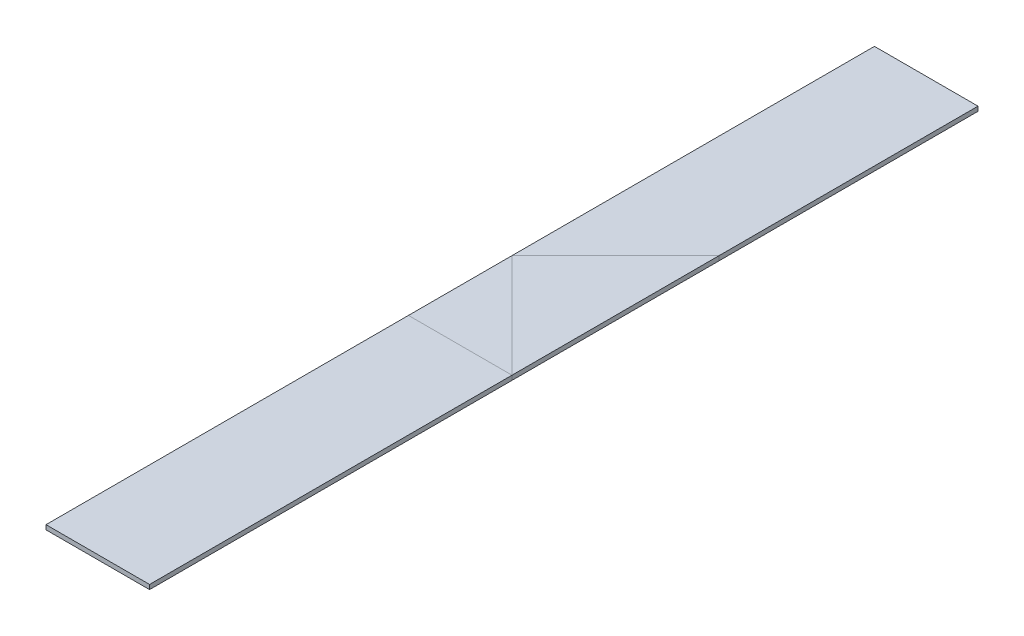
ISO-10303-21;
HEADER;
FILE_DESCRIPTION(('STEP AP214'),'2;1');
FILE_NAME('part.step','',(''),(''),'','','');
FILE_SCHEMA(('AUTOMOTIVE_DESIGN { 1 0 10303 214 1 1 1 1 }'));
ENDSEC;
DATA;
#1=APPLICATION_CONTEXT('core data for automotive mechanical design processes');
#2=APPLICATION_PROTOCOL_DEFINITION('international standard','automotive_design',2000,#1);
#3=PRODUCT_CONTEXT('',#1,'mechanical');
#4=PRODUCT('Part','Part','',(#3));
#5=PRODUCT_RELATED_PRODUCT_CATEGORY('part','',(#4));
#6=PRODUCT_DEFINITION_FORMATION('','',#4);
#7=PRODUCT_DEFINITION_CONTEXT('part definition',#1,'design');
#8=PRODUCT_DEFINITION('design','',#6,#7);
#9=PRODUCT_DEFINITION_SHAPE('','',#8);
#10=(LENGTH_UNIT() NAMED_UNIT(*) SI_UNIT(.MILLI.,.METRE.));
#11=(NAMED_UNIT(*) PLANE_ANGLE_UNIT() SI_UNIT($,.RADIAN.));
#12=(NAMED_UNIT(*) SI_UNIT($,.STERADIAN.) SOLID_ANGLE_UNIT());
#13=UNCERTAINTY_MEASURE_WITH_UNIT(LENGTH_MEASURE(1.E-05),#10,'distance_accuracy_value','');
#14=(GEOMETRIC_REPRESENTATION_CONTEXT(3) GLOBAL_UNCERTAINTY_ASSIGNED_CONTEXT((#13)) GLOBAL_UNIT_ASSIGNED_CONTEXT((#10,
#11,#12)) REPRESENTATION_CONTEXT('',''));
#15=CARTESIAN_POINT('',(0.,0.,0.));
#16=DIRECTION('',(0.,0.,1.));
#17=DIRECTION('',(1.,0.,0.));
#18=AXIS2_PLACEMENT_3D('',#15,#16,#17);
#19=CARTESIAN_POINT('',(0.,1.,-80.5));
#20=DIRECTION('',(0.,0.,-1.));
#21=DIRECTION('',(-1.,0.,0.));
#22=AXIS2_PLACEMENT_3D('',#19,#20,#21);
#23=PLANE('',#22);
#24=DIRECTION('',(1.,0.,0.));
#25=VECTOR('',#24,1.);
#26=CARTESIAN_POINT('',(0.,0.,-80.5));
#27=LINE('',#26,#25);
#28=CARTESIAN_POINT('',(0.,0.,-80.5));
#29=VERTEX_POINT('',#28);
#30=CARTESIAN_POINT('',(23.,0.,-80.5));
#31=VERTEX_POINT('',#30);
#32=EDGE_CURVE('E111',#29,#31,#27,.T.);
#33=ORIENTED_EDGE('',*,*,#32,.F.);
#34=DIRECTION('',(0.,-1.,0.));
#35=VECTOR('',#34,1.);
#36=CARTESIAN_POINT('',(0.,1.,-80.5));
#37=LINE('',#36,#35);
#38=CARTESIAN_POINT('',(0.,1.,-80.5));
#39=VERTEX_POINT('',#38);
#40=EDGE_CURVE('E12',#39,#29,#37,.T.);
#41=ORIENTED_EDGE('',*,*,#40,.F.);
#42=DIRECTION('',(1.,0.,0.));
#43=VECTOR('',#42,1.);
#44=CARTESIAN_POINT('',(0.,1.,-80.5));
#45=LINE('',#44,#43);
#46=CARTESIAN_POINT('',(23.,1.,-80.5));
#47=VERTEX_POINT('',#46);
#48=EDGE_CURVE('E105',#39,#47,#45,.T.);
#49=ORIENTED_EDGE('',*,*,#48,.T.);
#50=DIRECTION('',(0.,-1.,0.));
#51=VECTOR('',#50,1.);
#52=CARTESIAN_POINT('',(23.,1.,-80.5));
#53=LINE('',#52,#51);
#54=EDGE_CURVE('E86',#47,#31,#53,.T.);
#55=ORIENTED_EDGE('',*,*,#54,.T.);
#56=EDGE_LOOP('',(#33,#41,#49,#55));
#57=FACE_BOUND('',#56,.T.);
#58=ADVANCED_FACE('F48',(#57),#23,.T.);
#59=CARTESIAN_POINT('',(0.,1.,0.));
#60=DIRECTION('',(-1.,0.,0.));
#61=DIRECTION('',(0.,0.,1.));
#62=AXIS2_PLACEMENT_3D('',#59,#60,#61);
#63=PLANE('',#62);
#64=DIRECTION('',(0.,0.,-1.));
#65=VECTOR('',#64,1.);
#66=CARTESIAN_POINT('',(0.,0.,0.));
#67=LINE('',#66,#65);
#68=CARTESIAN_POINT('',(0.,0.,0.));
#69=VERTEX_POINT('',#68);
#70=EDGE_CURVE('E99',#69,#29,#67,.T.);
#71=ORIENTED_EDGE('',*,*,#70,.F.);
#72=DIRECTION('',(0.,-1.,0.));
#73=VECTOR('',#72,1.);
#74=CARTESIAN_POINT('',(0.,1.,0.));
#75=LINE('',#74,#73);
#76=CARTESIAN_POINT('',(0.,1.,0.));
#77=VERTEX_POINT('',#76);
#78=EDGE_CURVE('E56',#77,#69,#75,.T.);
#79=ORIENTED_EDGE('',*,*,#78,.F.);
#80=DIRECTION('',(0.,0.,-1.));
#81=VECTOR('',#80,1.);
#82=CARTESIAN_POINT('',(0.,1.,0.));
#83=LINE('',#82,#81);
#84=EDGE_CURVE('E97',#77,#39,#83,.T.);
#85=ORIENTED_EDGE('',*,*,#84,.T.);
#86=ORIENTED_EDGE('',*,*,#40,.T.);
#87=EDGE_LOOP('',(#71,#79,#85,#86));
#88=FACE_BOUND('',#87,.T.);
#89=ADVANCED_FACE('F95',(#88),#63,.T.);
#90=CARTESIAN_POINT('',(0.,1.,0.));
#91=DIRECTION('',(0.,0.,-1.));
#92=DIRECTION('',(-1.,0.,0.));
#93=AXIS2_PLACEMENT_3D('',#90,#91,#92);
#94=PLANE('',#93);
#95=DIRECTION('',(1.,0.,0.));
#96=VECTOR('',#95,1.);
#97=CARTESIAN_POINT('',(0.,0.,0.));
#98=LINE('',#97,#96);
#99=CARTESIAN_POINT('',(23.,0.,0.));
#100=VERTEX_POINT('',#99);
#101=EDGE_CURVE('E79',#69,#100,#98,.T.);
#102=ORIENTED_EDGE('',*,*,#101,.T.);
#103=DIRECTION('',(0.,-1.,0.));
#104=VECTOR('',#103,1.);
#105=CARTESIAN_POINT('',(23.,1.,0.));
#106=LINE('',#105,#104);
#107=CARTESIAN_POINT('',(23.,1.,0.));
#108=VERTEX_POINT('',#107);
#109=EDGE_CURVE('E100',#108,#100,#106,.T.);
#110=ORIENTED_EDGE('',*,*,#109,.F.);
#111=DIRECTION('',(1.,0.,0.));
#112=VECTOR('',#111,1.);
#113=CARTESIAN_POINT('',(0.,1.,0.));
#114=LINE('',#113,#112);
#115=EDGE_CURVE('E101',#77,#108,#114,.T.);
#116=ORIENTED_EDGE('',*,*,#115,.F.);
#117=ORIENTED_EDGE('',*,*,#78,.T.);
#118=EDGE_LOOP('',(#102,#110,#116,#117));
#119=FACE_BOUND('',#118,.T.);
#120=ADVANCED_FACE('F102',(#119),#94,.F.);
#121=CARTESIAN_POINT('',(23.,1.,0.));
#122=DIRECTION('',(-1.,0.,0.));
#123=DIRECTION('',(0.,0.,1.));
#124=AXIS2_PLACEMENT_3D('',#121,#122,#123);
#125=PLANE('',#124);
#126=DIRECTION('',(0.,0.,-1.));
#127=VECTOR('',#126,1.);
#128=CARTESIAN_POINT('',(23.,0.,0.));
#129=LINE('',#128,#127);
#130=EDGE_CURVE('E107',#100,#31,#129,.T.);
#131=ORIENTED_EDGE('',*,*,#130,.T.);
#132=ORIENTED_EDGE('',*,*,#54,.F.);
#133=DIRECTION('',(0.,0.,-1.));
#134=VECTOR('',#133,1.);
#135=CARTESIAN_POINT('',(23.,1.,0.));
#136=LINE('',#135,#134);
#137=EDGE_CURVE('E64',#108,#47,#136,.T.);
#138=ORIENTED_EDGE('',*,*,#137,.F.);
#139=ORIENTED_EDGE('',*,*,#109,.T.);
#140=EDGE_LOOP('',(#131,#132,#138,#139));
#141=FACE_BOUND('',#140,.T.);
#142=ADVANCED_FACE('F120',(#141),#125,.F.);
#143=CARTESIAN_POINT('',(0.,1.,0.));
#144=DIRECTION('',(0.,1.,0.));
#145=DIRECTION('',(0.,0.,1.));
#146=AXIS2_PLACEMENT_3D('',#143,#144,#145);
#147=PLANE('',#146);
#148=ORIENTED_EDGE('',*,*,#48,.F.);
#149=ORIENTED_EDGE('',*,*,#84,.F.);
#150=ORIENTED_EDGE('',*,*,#115,.T.);
#151=ORIENTED_EDGE('',*,*,#137,.T.);
#152=EDGE_LOOP('',(#148,#149,#150,#151));
#153=FACE_BOUND('',#152,.T.);
#154=ADVANCED_FACE('F104',(#153),#147,.T.);
#155=CARTESIAN_POINT('',(0.,0.,0.));
#156=DIRECTION('',(0.,1.,0.));
#157=DIRECTION('',(0.,0.,1.));
#158=AXIS2_PLACEMENT_3D('',#155,#156,#157);
#159=PLANE('',#158);
#160=ORIENTED_EDGE('',*,*,#32,.T.);
#161=ORIENTED_EDGE('',*,*,#130,.F.);
#162=ORIENTED_EDGE('',*,*,#101,.F.);
#163=ORIENTED_EDGE('',*,*,#70,.T.);
#164=EDGE_LOOP('',(#160,#161,#162,#163));
#165=FACE_BOUND('',#164,.T.);
#166=ADVANCED_FACE('F122',(#165),#159,.F.);
#167=CLOSED_SHELL('',(#58,#89,#120,#142,#154,#166));
#168=MANIFOLD_SOLID_BREP('B2',#167);
#169=CARTESIAN_POINT('',(0.,1.,-80.5));
#170=DIRECTION('',(0.,0.,-1.));
#171=DIRECTION('',(-1.,0.,0.));
#172=AXIS2_PLACEMENT_3D('',#169,#170,#171);
#173=PLANE('',#172);
#174=DIRECTION('',(1.,0.,0.));
#175=VECTOR('',#174,1.);
#176=CARTESIAN_POINT('',(0.,0.,-80.5));
#177=LINE('',#176,#175);
#178=CARTESIAN_POINT('',(0.,0.,-80.5));
#179=VERTEX_POINT('',#178);
#180=CARTESIAN_POINT('',(23.,0.,-80.5));
#181=VERTEX_POINT('',#180);
#182=EDGE_CURVE('E228',#179,#181,#177,.T.);
#183=ORIENTED_EDGE('',*,*,#182,.T.);
#184=DIRECTION('',(0.,-1.,0.));
#185=VECTOR('',#184,1.);
#186=CARTESIAN_POINT('',(23.,1.,-80.5));
#187=LINE('',#186,#185);
#188=CARTESIAN_POINT('',(23.,1.,-80.5));
#189=VERTEX_POINT('',#188);
#190=EDGE_CURVE('E46',#189,#181,#187,.T.);
#191=ORIENTED_EDGE('',*,*,#190,.F.);
#192=DIRECTION('',(1.,0.,0.));
#193=VECTOR('',#192,1.);
#194=CARTESIAN_POINT('',(0.,1.,-80.5));
#195=LINE('',#194,#193);
#196=CARTESIAN_POINT('',(0.,1.,-80.5));
#197=VERTEX_POINT('',#196);
#198=EDGE_CURVE('E223',#197,#189,#195,.T.);
#199=ORIENTED_EDGE('',*,*,#198,.F.);
#200=DIRECTION('',(0.,-1.,0.));
#201=VECTOR('',#200,1.);
#202=CARTESIAN_POINT('',(0.,1.,-80.5));
#203=LINE('',#202,#201);
#204=EDGE_CURVE('E198',#197,#179,#203,.T.);
#205=ORIENTED_EDGE('',*,*,#204,.T.);
#206=EDGE_LOOP('',(#183,#191,#199,#205));
#207=FACE_BOUND('',#206,.T.);
#208=ADVANCED_FACE('F182',(#207),#173,.F.);
#209=CARTESIAN_POINT('',(51.7500000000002,1.,-51.7499999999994));
#210=DIRECTION('',(-0.707106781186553,0.,0.707106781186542));
#211=DIRECTION('',(0.707106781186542,0.,0.707106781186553));
#212=AXIS2_PLACEMENT_3D('',#209,#210,#211);
#213=PLANE('',#212);
#214=DIRECTION('',(-0.707106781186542,0.,-0.707106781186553));
#215=VECTOR('',#214,1.);
#216=CARTESIAN_POINT('',(51.7500000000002,0.,-51.7499999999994));
#217=LINE('',#216,#215);
#218=CARTESIAN_POINT('',(0.,0.,-103.5));
#219=VERTEX_POINT('',#218);
#220=EDGE_CURVE('E231',#181,#219,#217,.T.);
#221=ORIENTED_EDGE('',*,*,#220,.T.);
#222=DIRECTION('',(0.,-1.,0.));
#223=VECTOR('',#222,1.);
#224=CARTESIAN_POINT('',(0.,1.,-103.5));
#225=LINE('',#224,#223);
#226=CARTESIAN_POINT('',(0.,1.,-103.5));
#227=VERTEX_POINT('',#226);
#228=EDGE_CURVE('E190',#227,#219,#225,.T.);
#229=ORIENTED_EDGE('',*,*,#228,.F.);
#230=DIRECTION('',(-0.707106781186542,0.,-0.707106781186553));
#231=VECTOR('',#230,1.);
#232=CARTESIAN_POINT('',(51.7500000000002,1.,-51.7499999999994));
#233=LINE('',#232,#231);
#234=EDGE_CURVE('E216',#189,#227,#233,.T.);
#235=ORIENTED_EDGE('',*,*,#234,.F.);
#236=ORIENTED_EDGE('',*,*,#190,.T.);
#237=EDGE_LOOP('',(#221,#229,#235,#236));
#238=FACE_BOUND('',#237,.T.);
#239=ADVANCED_FACE('F218',(#238),#213,.F.);
#240=CARTESIAN_POINT('',(0.,1.,0.));
#241=DIRECTION('',(-1.,0.,0.));
#242=DIRECTION('',(0.,0.,1.));
#243=AXIS2_PLACEMENT_3D('',#240,#241,#242);
#244=PLANE('',#243);
#245=DIRECTION('',(0.,0.,-1.));
#246=VECTOR('',#245,1.);
#247=CARTESIAN_POINT('',(0.,0.,0.));
#248=LINE('',#247,#246);
#249=EDGE_CURVE('E226',#179,#219,#248,.T.);
#250=ORIENTED_EDGE('',*,*,#249,.F.);
#251=ORIENTED_EDGE('',*,*,#204,.F.);
#252=DIRECTION('',(0.,0.,-1.));
#253=VECTOR('',#252,1.);
#254=CARTESIAN_POINT('',(0.,1.,0.));
#255=LINE('',#254,#253);
#256=EDGE_CURVE('E222',#197,#227,#255,.T.);
#257=ORIENTED_EDGE('',*,*,#256,.T.);
#258=ORIENTED_EDGE('',*,*,#228,.T.);
#259=EDGE_LOOP('',(#250,#251,#257,#258));
#260=FACE_BOUND('',#259,.T.);
#261=ADVANCED_FACE('F237',(#260),#244,.T.);
#262=CARTESIAN_POINT('',(0.,1.,0.));
#263=DIRECTION('',(0.,1.,0.));
#264=DIRECTION('',(0.,0.,1.));
#265=AXIS2_PLACEMENT_3D('',#262,#263,#264);
#266=PLANE('',#265);
#267=ORIENTED_EDGE('',*,*,#198,.T.);
#268=ORIENTED_EDGE('',*,*,#234,.T.);
#269=ORIENTED_EDGE('',*,*,#256,.F.);
#270=EDGE_LOOP('',(#267,#268,#269));
#271=FACE_BOUND('',#270,.T.);
#272=ADVANCED_FACE('F225',(#271),#266,.T.);
#273=CARTESIAN_POINT('',(0.,0.,0.));
#274=DIRECTION('',(0.,1.,0.));
#275=DIRECTION('',(0.,0.,1.));
#276=AXIS2_PLACEMENT_3D('',#273,#274,#275);
#277=PLANE('',#276);
#278=ORIENTED_EDGE('',*,*,#182,.F.);
#279=ORIENTED_EDGE('',*,*,#249,.T.);
#280=ORIENTED_EDGE('',*,*,#220,.F.);
#281=EDGE_LOOP('',(#278,#279,#280));
#282=FACE_BOUND('',#281,.T.);
#283=ADVANCED_FACE('F244',(#282),#277,.F.);
#284=CLOSED_SHELL('',(#208,#239,#261,#272,#283));
#285=MANIFOLD_SOLID_BREP('B6',#284);
#286=CARTESIAN_POINT('',(0.,1.,0.));
#287=DIRECTION('',(-1.,0.,0.));
#288=DIRECTION('',(0.,0.,1.));
#289=AXIS2_PLACEMENT_3D('',#286,#287,#288);
#290=PLANE('',#289);
#291=DIRECTION('',(0.,0.,-1.));
#292=VECTOR('',#291,1.);
#293=CARTESIAN_POINT('',(0.,0.,0.));
#294=LINE('',#293,#292);
#295=CARTESIAN_POINT('',(0.,0.,-103.5));
#296=VERTEX_POINT('',#295);
#297=CARTESIAN_POINT('',(0.,0.,-184.));
#298=VERTEX_POINT('',#297);
#299=EDGE_CURVE('E351',#296,#298,#294,.T.);
#300=ORIENTED_EDGE('',*,*,#299,.F.);
#301=DIRECTION('',(0.,-1.,0.));
#302=VECTOR('',#301,1.);
#303=CARTESIAN_POINT('',(0.,1.,-103.5));
#304=LINE('',#303,#302);
#305=CARTESIAN_POINT('',(0.,1.,-103.5));
#306=VERTEX_POINT('',#305);
#307=EDGE_CURVE('E180',#306,#296,#304,.T.);
#308=ORIENTED_EDGE('',*,*,#307,.F.);
#309=DIRECTION('',(0.,0.,-1.));
#310=VECTOR('',#309,1.);
#311=CARTESIAN_POINT('',(0.,1.,0.));
#312=LINE('',#311,#310);
#313=CARTESIAN_POINT('',(0.,1.,-184.));
#314=VERTEX_POINT('',#313);
#315=EDGE_CURVE('E339',#306,#314,#312,.T.);
#316=ORIENTED_EDGE('',*,*,#315,.T.);
#317=DIRECTION('',(0.,-1.,0.));
#318=VECTOR('',#317,1.);
#319=CARTESIAN_POINT('',(0.,1.,-184.));
#320=LINE('',#319,#318);
#321=EDGE_CURVE('E328',#314,#298,#320,.T.);
#322=ORIENTED_EDGE('',*,*,#321,.T.);
#323=EDGE_LOOP('',(#300,#308,#316,#322));
#324=FACE_BOUND('',#323,.T.);
#325=ADVANCED_FACE('F289',(#324),#290,.T.);
#326=CARTESIAN_POINT('',(-51.7500000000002,1.,-51.750000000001));
#327=DIRECTION('',(-0.707106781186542,0.,-0.707106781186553));
#328=DIRECTION('',(-0.707106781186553,0.,0.707106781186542));
#329=AXIS2_PLACEMENT_3D('',#326,#327,#328);
#330=PLANE('',#329);
#331=DIRECTION('',(0.707106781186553,0.,-0.707106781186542));
#332=VECTOR('',#331,1.);
#333=CARTESIAN_POINT('',(-51.7500000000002,0.,-51.750000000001));
#334=LINE('',#333,#332);
#335=CARTESIAN_POINT('',(23.,0.,-126.5));
#336=VERTEX_POINT('',#335);
#337=EDGE_CURVE('E344',#296,#336,#334,.T.);
#338=ORIENTED_EDGE('',*,*,#337,.T.);
#339=DIRECTION('',(0.,-1.,0.));
#340=VECTOR('',#339,1.);
#341=CARTESIAN_POINT('',(23.,1.,-126.5));
#342=LINE('',#341,#340);
#343=CARTESIAN_POINT('',(23.,1.,-126.5));
#344=VERTEX_POINT('',#343);
#345=EDGE_CURVE('E297',#344,#336,#342,.T.);
#346=ORIENTED_EDGE('',*,*,#345,.F.);
#347=DIRECTION('',(0.707106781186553,0.,-0.707106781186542));
#348=VECTOR('',#347,1.);
#349=CARTESIAN_POINT('',(-51.7500000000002,1.,-51.750000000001));
#350=LINE('',#349,#348);
#351=EDGE_CURVE('E334',#306,#344,#350,.T.);
#352=ORIENTED_EDGE('',*,*,#351,.F.);
#353=ORIENTED_EDGE('',*,*,#307,.T.);
#354=EDGE_LOOP('',(#338,#346,#352,#353));
#355=FACE_BOUND('',#354,.T.);
#356=ADVANCED_FACE('F342',(#355),#330,.F.);
#357=CARTESIAN_POINT('',(23.,1.,0.));
#358=DIRECTION('',(-1.,0.,0.));
#359=DIRECTION('',(0.,0.,1.));
#360=AXIS2_PLACEMENT_3D('',#357,#358,#359);
#361=PLANE('',#360);
#362=DIRECTION('',(0.,0.,-1.));
#363=VECTOR('',#362,1.);
#364=CARTESIAN_POINT('',(23.,0.,0.));
#365=LINE('',#364,#363);
#366=CARTESIAN_POINT('',(23.,0.,-184.));
#367=VERTEX_POINT('',#366);
#368=EDGE_CURVE('E321',#336,#367,#365,.T.);
#369=ORIENTED_EDGE('',*,*,#368,.T.);
#370=DIRECTION('',(0.,-1.,0.));
#371=VECTOR('',#370,1.);
#372=CARTESIAN_POINT('',(23.,1.,-184.));
#373=LINE('',#372,#371);
#374=CARTESIAN_POINT('',(23.,1.,-184.));
#375=VERTEX_POINT('',#374);
#376=EDGE_CURVE('E345',#375,#367,#373,.T.);
#377=ORIENTED_EDGE('',*,*,#376,.F.);
#378=DIRECTION('',(0.,0.,-1.));
#379=VECTOR('',#378,1.);
#380=CARTESIAN_POINT('',(23.,1.,0.));
#381=LINE('',#380,#379);
#382=EDGE_CURVE('E338',#344,#375,#381,.T.);
#383=ORIENTED_EDGE('',*,*,#382,.F.);
#384=ORIENTED_EDGE('',*,*,#345,.T.);
#385=EDGE_LOOP('',(#369,#377,#383,#384));
#386=FACE_BOUND('',#385,.T.);
#387=ADVANCED_FACE('F346',(#386),#361,.F.);
#388=CARTESIAN_POINT('',(0.,1.,-184.));
#389=DIRECTION('',(0.,0.,1.));
#390=DIRECTION('',(1.,0.,0.));
#391=AXIS2_PLACEMENT_3D('',#388,#389,#390);
#392=PLANE('',#391);
#393=DIRECTION('',(-1.,0.,0.));
#394=VECTOR('',#393,1.);
#395=CARTESIAN_POINT('',(0.,0.,-184.));
#396=LINE('',#395,#394);
#397=EDGE_CURVE('E356',#367,#298,#396,.T.);
#398=ORIENTED_EDGE('',*,*,#397,.T.);
#399=ORIENTED_EDGE('',*,*,#321,.F.);
#400=DIRECTION('',(-1.,0.,0.));
#401=VECTOR('',#400,1.);
#402=CARTESIAN_POINT('',(0.,1.,-184.));
#403=LINE('',#402,#401);
#404=EDGE_CURVE('E305',#375,#314,#403,.T.);
#405=ORIENTED_EDGE('',*,*,#404,.F.);
#406=ORIENTED_EDGE('',*,*,#376,.T.);
#407=EDGE_LOOP('',(#398,#399,#405,#406));
#408=FACE_BOUND('',#407,.T.);
#409=ADVANCED_FACE('F361',(#408),#392,.F.);
#410=CARTESIAN_POINT('',(0.,1.,0.));
#411=DIRECTION('',(0.,1.,0.));
#412=DIRECTION('',(0.,0.,1.));
#413=AXIS2_PLACEMENT_3D('',#410,#411,#412);
#414=PLANE('',#413);
#415=ORIENTED_EDGE('',*,*,#315,.F.);
#416=ORIENTED_EDGE('',*,*,#351,.T.);
#417=ORIENTED_EDGE('',*,*,#382,.T.);
#418=ORIENTED_EDGE('',*,*,#404,.T.);
#419=EDGE_LOOP('',(#415,#416,#417,#418));
#420=FACE_BOUND('',#419,.T.);
#421=ADVANCED_FACE('F336',(#420),#414,.T.);
#422=CARTESIAN_POINT('',(0.,0.,0.));
#423=DIRECTION('',(0.,1.,0.));
#424=DIRECTION('',(0.,0.,1.));
#425=AXIS2_PLACEMENT_3D('',#422,#423,#424);
#426=PLANE('',#425);
#427=ORIENTED_EDGE('',*,*,#299,.T.);
#428=ORIENTED_EDGE('',*,*,#397,.F.);
#429=ORIENTED_EDGE('',*,*,#368,.F.);
#430=ORIENTED_EDGE('',*,*,#337,.F.);
#431=EDGE_LOOP('',(#427,#428,#429,#430));
#432=FACE_BOUND('',#431,.T.);
#433=ADVANCED_FACE('F363',(#432),#426,.F.);
#434=CLOSED_SHELL('',(#325,#356,#387,#409,#421,#433));
#435=MANIFOLD_SOLID_BREP('B40',#434);
#436=CARTESIAN_POINT('',(-51.7500000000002,1.,-51.750000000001));
#437=DIRECTION('',(-0.707106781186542,0.,-0.707106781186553));
#438=DIRECTION('',(-0.707106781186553,0.,0.707106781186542));
#439=AXIS2_PLACEMENT_3D('',#436,#437,#438);
#440=PLANE('',#439);
#441=DIRECTION('',(0.707106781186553,0.,-0.707106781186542));
#442=VECTOR('',#441,1.);
#443=CARTESIAN_POINT('',(-51.7500000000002,0.,-51.750000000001));
#444=LINE('',#443,#442);
#445=CARTESIAN_POINT('',(0.,0.,-103.5));
#446=VERTEX_POINT('',#445);
#447=CARTESIAN_POINT('',(23.,0.,-126.5));
#448=VERTEX_POINT('',#447);
#449=EDGE_CURVE('E450',#446,#448,#444,.T.);
#450=ORIENTED_EDGE('',*,*,#449,.F.);
#451=DIRECTION('',(0.,-1.,0.));
#452=VECTOR('',#451,1.);
#453=CARTESIAN_POINT('',(0.,1.,-103.5));
#454=LINE('',#453,#452);
#455=CARTESIAN_POINT('',(0.,1.,-103.5));
#456=VERTEX_POINT('',#455);
#457=EDGE_CURVE('E287',#456,#446,#454,.T.);
#458=ORIENTED_EDGE('',*,*,#457,.F.);
#459=DIRECTION('',(0.707106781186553,0.,-0.707106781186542));
#460=VECTOR('',#459,1.);
#461=CARTESIAN_POINT('',(-51.7500000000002,1.,-51.750000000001));
#462=LINE('',#461,#460);
#463=CARTESIAN_POINT('',(23.,1.,-126.5));
#464=VERTEX_POINT('',#463);
#465=EDGE_CURVE('E448',#456,#464,#462,.T.);
#466=ORIENTED_EDGE('',*,*,#465,.T.);
#467=DIRECTION('',(0.,-1.,0.));
#468=VECTOR('',#467,1.);
#469=CARTESIAN_POINT('',(23.,1.,-126.5));
#470=LINE('',#469,#468);
#471=EDGE_CURVE('E446',#464,#448,#470,.T.);
#472=ORIENTED_EDGE('',*,*,#471,.T.);
#473=EDGE_LOOP('',(#450,#458,#466,#472));
#474=FACE_BOUND('',#473,.T.);
#475=ADVANCED_FACE('F413',(#474),#440,.T.);
#476=CARTESIAN_POINT('',(51.7500000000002,1.,-51.7499999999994));
#477=DIRECTION('',(-0.707106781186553,0.,0.707106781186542));
#478=DIRECTION('',(0.707106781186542,0.,0.707106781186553));
#479=AXIS2_PLACEMENT_3D('',#476,#477,#478);
#480=PLANE('',#479);
#481=DIRECTION('',(-0.707106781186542,0.,-0.707106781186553));
#482=VECTOR('',#481,1.);
#483=CARTESIAN_POINT('',(51.7500000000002,0.,-51.7499999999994));
#484=LINE('',#483,#482);
#485=CARTESIAN_POINT('',(23.,0.,-80.5));
#486=VERTEX_POINT('',#485);
#487=EDGE_CURVE('E464',#486,#446,#484,.T.);
#488=ORIENTED_EDGE('',*,*,#487,.F.);
#489=DIRECTION('',(0.,-1.,0.));
#490=VECTOR('',#489,1.);
#491=CARTESIAN_POINT('',(23.,1.,-80.5));
#492=LINE('',#491,#490);
#493=CARTESIAN_POINT('',(23.,1.,-80.5));
#494=VERTEX_POINT('',#493);
#495=EDGE_CURVE('E421',#494,#486,#492,.T.);
#496=ORIENTED_EDGE('',*,*,#495,.F.);
#497=DIRECTION('',(-0.707106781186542,0.,-0.707106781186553));
#498=VECTOR('',#497,1.);
#499=CARTESIAN_POINT('',(51.7500000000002,1.,-51.7499999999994));
#500=LINE('',#499,#498);
#501=EDGE_CURVE('E456',#494,#456,#500,.T.);
#502=ORIENTED_EDGE('',*,*,#501,.T.);
#503=ORIENTED_EDGE('',*,*,#457,.T.);
#504=EDGE_LOOP('',(#488,#496,#502,#503));
#505=FACE_BOUND('',#504,.T.);
#506=ADVANCED_FACE('F459',(#505),#480,.T.);
#507=CARTESIAN_POINT('',(23.,1.,0.));
#508=DIRECTION('',(-1.,0.,0.));
#509=DIRECTION('',(0.,0.,1.));
#510=AXIS2_PLACEMENT_3D('',#507,#508,#509);
#511=PLANE('',#510);
#512=DIRECTION('',(0.,0.,-1.));
#513=VECTOR('',#512,1.);
#514=CARTESIAN_POINT('',(23.,0.,0.));
#515=LINE('',#514,#513);
#516=EDGE_CURVE('E457',#486,#448,#515,.T.);
#517=ORIENTED_EDGE('',*,*,#516,.T.);
#518=ORIENTED_EDGE('',*,*,#471,.F.);
#519=DIRECTION('',(0.,0.,-1.));
#520=VECTOR('',#519,1.);
#521=CARTESIAN_POINT('',(23.,1.,0.));
#522=LINE('',#521,#520);
#523=EDGE_CURVE('E429',#494,#464,#522,.T.);
#524=ORIENTED_EDGE('',*,*,#523,.F.);
#525=ORIENTED_EDGE('',*,*,#495,.T.);
#526=EDGE_LOOP('',(#517,#518,#524,#525));
#527=FACE_BOUND('',#526,.T.);
#528=ADVANCED_FACE('F467',(#527),#511,.F.);
#529=CARTESIAN_POINT('',(0.,1.,0.));
#530=DIRECTION('',(0.,1.,0.));
#531=DIRECTION('',(0.,0.,1.));
#532=AXIS2_PLACEMENT_3D('',#529,#530,#531);
#533=PLANE('',#532);
#534=ORIENTED_EDGE('',*,*,#465,.F.);
#535=ORIENTED_EDGE('',*,*,#501,.F.);
#536=ORIENTED_EDGE('',*,*,#523,.T.);
#537=EDGE_LOOP('',(#534,#535,#536));
#538=FACE_BOUND('',#537,.T.);
#539=ADVANCED_FACE('F455',(#538),#533,.T.);
#540=CARTESIAN_POINT('',(0.,0.,0.));
#541=DIRECTION('',(0.,1.,0.));
#542=DIRECTION('',(0.,0.,1.));
#543=AXIS2_PLACEMENT_3D('',#540,#541,#542);
#544=PLANE('',#543);
#545=ORIENTED_EDGE('',*,*,#449,.T.);
#546=ORIENTED_EDGE('',*,*,#516,.F.);
#547=ORIENTED_EDGE('',*,*,#487,.T.);
#548=EDGE_LOOP('',(#545,#546,#547));
#549=FACE_BOUND('',#548,.T.);
#550=ADVANCED_FACE('F469',(#549),#544,.F.);
#551=CLOSED_SHELL('',(#475,#506,#528,#539,#550));
#552=MANIFOLD_SOLID_BREP('B174',#551);
#553=ADVANCED_BREP_SHAPE_REPRESENTATION('',(#18,#168,#285,#435,#552),#14);
#554=SHAPE_DEFINITION_REPRESENTATION(#9,#553);
ENDSEC;
END-ISO-10303-21;
